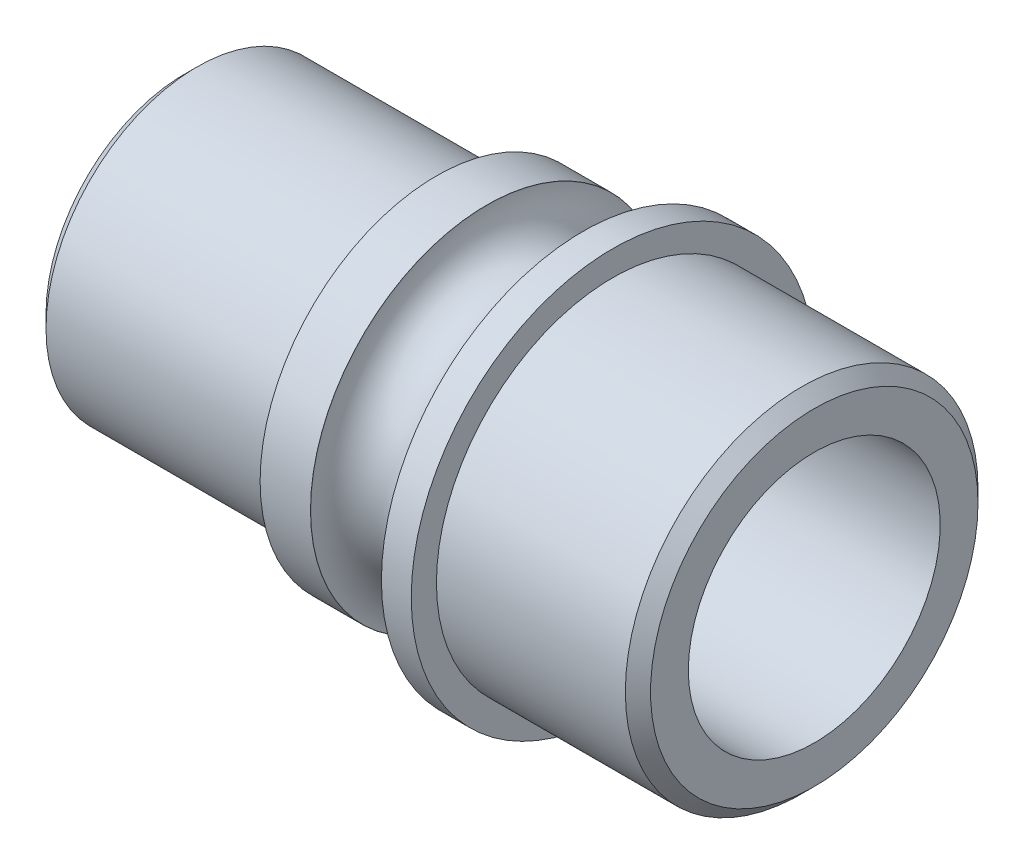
ISO-10303-21;
HEADER;
FILE_DESCRIPTION(('STEP AP214'),'2;1');
FILE_NAME('part.step','',(''),(''),'','','');
FILE_SCHEMA(('AUTOMOTIVE_DESIGN { 1 0 10303 214 1 1 1 1 }'));
ENDSEC;
DATA;
#1=APPLICATION_CONTEXT('core data for automotive mechanical design processes');
#2=APPLICATION_PROTOCOL_DEFINITION('international standard','automotive_design',2000,#1);
#3=PRODUCT_CONTEXT('',#1,'mechanical');
#4=PRODUCT('Part','Part','',(#3));
#5=PRODUCT_RELATED_PRODUCT_CATEGORY('part','',(#4));
#6=PRODUCT_DEFINITION_FORMATION('','',#4);
#7=PRODUCT_DEFINITION_CONTEXT('part definition',#1,'design');
#8=PRODUCT_DEFINITION('design','',#6,#7);
#9=PRODUCT_DEFINITION_SHAPE('','',#8);
#10=(LENGTH_UNIT() NAMED_UNIT(*) SI_UNIT(.MILLI.,.METRE.));
#11=(NAMED_UNIT(*) PLANE_ANGLE_UNIT() SI_UNIT($,.RADIAN.));
#12=(NAMED_UNIT(*) SI_UNIT($,.STERADIAN.) SOLID_ANGLE_UNIT());
#13=UNCERTAINTY_MEASURE_WITH_UNIT(LENGTH_MEASURE(1.E-05),#10,'distance_accuracy_value','');
#14=(GEOMETRIC_REPRESENTATION_CONTEXT(3) GLOBAL_UNCERTAINTY_ASSIGNED_CONTEXT((#13)) GLOBAL_UNIT_ASSIGNED_CONTEXT((#10,
#11,#12)) REPRESENTATION_CONTEXT('',''));
#15=CARTESIAN_POINT('',(0.,0.,0.));
#16=DIRECTION('',(0.,0.,1.));
#17=DIRECTION('',(1.,0.,0.));
#18=AXIS2_PLACEMENT_3D('',#15,#16,#17);
#19=CARTESIAN_POINT('',(-2.13336789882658,0.,0.));
#20=DIRECTION('',(1.,0.,0.));
#21=DIRECTION('',(0.,0.,-1.));
#22=AXIS2_PLACEMENT_3D('',#19,#20,#21);
#23=CONICAL_SURFACE('',#22,6.35604902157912,1.04719755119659);
#24=CARTESIAN_POINT('',(-1.18423235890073,0.,0.));
#25=DIRECTION('',(-1.,0.,0.));
#26=DIRECTION('',(0.,0.,1.));
#27=AXIS2_PLACEMENT_3D('',#24,#25,#26);
#28=CIRCLE('',#27,8.);
#29=CARTESIAN_POINT('',(-1.18423235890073,0.,8.));
#30=VERTEX_POINT('',#29);
#31=EDGE_CURVE('E108',#30,#30,#28,.T.);
#32=ORIENTED_EDGE('',*,*,#31,.T.);
#33=EDGE_LOOP('',(#32));
#34=FACE_BOUND('',#33,.T.);
#35=CARTESIAN_POINT('',(-2.13336789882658,0.,0.));
#36=DIRECTION('',(-1.,0.,0.));
#37=DIRECTION('',(0.,0.,1.));
#38=AXIS2_PLACEMENT_3D('',#35,#36,#37);
#39=CIRCLE('',#38,6.35604902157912);
#40=CARTESIAN_POINT('',(-2.13336789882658,0.,6.35604902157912));
#41=VERTEX_POINT('',#40);
#42=EDGE_CURVE('E73',#41,#41,#39,.T.);
#43=ORIENTED_EDGE('',*,*,#42,.F.);
#44=EDGE_LOOP('',(#43));
#45=FACE_BOUND('',#44,.T.);
#46=ADVANCED_FACE('F32',(#34,#45),#23,.T.);
#47=CARTESIAN_POINT('',(0.,0.,0.));
#48=DIRECTION('',(-1.,0.,0.));
#49=DIRECTION('',(0.,0.,1.));
#50=AXIS2_PLACEMENT_3D('',#47,#48,#49);
#51=CYLINDRICAL_SURFACE('',#50,6.35604902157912);
#52=ORIENTED_EDGE('',*,*,#42,.T.);
#53=EDGE_LOOP('',(#52));
#54=FACE_BOUND('',#53,.T.);
#55=CARTESIAN_POINT('',(-2.14007077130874,0.,0.));
#56=DIRECTION('',(-1.,0.,0.));
#57=DIRECTION('',(0.,0.,1.));
#58=AXIS2_PLACEMENT_3D('',#55,#56,#57);
#59=CIRCLE('',#58,6.35604902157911);
#60=CARTESIAN_POINT('',(-2.14007077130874,0.,6.35604902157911));
#61=VERTEX_POINT('',#60);
#62=EDGE_CURVE('E70',#61,#61,#59,.T.);
#63=ORIENTED_EDGE('',*,*,#62,.F.);
#64=EDGE_LOOP('',(#63));
#65=FACE_BOUND('',#64,.T.);
#66=ADVANCED_FACE('F98',(#54,#65),#51,.T.);
#67=CARTESIAN_POINT('',(-3.5,0.,0.));
#68=DIRECTION('',(-1.,0.,0.));
#69=DIRECTION('',(0.,0.,1.));
#70=AXIS2_PLACEMENT_3D('',#67,#68,#69);
#71=TOROIDAL_SURFACE('',#70,6.98897278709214,1.5);
#72=ORIENTED_EDGE('',*,*,#62,.T.);
#73=EDGE_LOOP('',(#72));
#74=FACE_BOUND('',#73,.T.);
#75=CARTESIAN_POINT('',(-5.,0.,0.));
#76=DIRECTION('',(-1.,0.,0.));
#77=DIRECTION('',(0.,0.,1.));
#78=AXIS2_PLACEMENT_3D('',#75,#76,#77);
#79=CIRCLE('',#78,6.98897278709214);
#80=CARTESIAN_POINT('',(-5.,0.,6.98897278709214));
#81=VERTEX_POINT('',#80);
#82=EDGE_CURVE('E67',#81,#81,#79,.T.);
#83=ORIENTED_EDGE('',*,*,#82,.F.);
#84=EDGE_LOOP('',(#83));
#85=FACE_BOUND('',#84,.T.);
#86=ADVANCED_FACE('F103',(#74,#85),#71,.F.);
#87=CARTESIAN_POINT('',(-5.,7.00000000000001,0.));
#88=DIRECTION('',(1.,0.,0.));
#89=DIRECTION('',(0.,0.,-1.));
#90=AXIS2_PLACEMENT_3D('',#87,#88,#89);
#91=PLANE('',#90);
#92=ORIENTED_EDGE('',*,*,#82,.T.);
#93=EDGE_LOOP('',(#92));
#94=FACE_BOUND('',#93,.T.);
#95=CARTESIAN_POINT('',(-5.,0.,0.));
#96=DIRECTION('',(-1.,0.,0.));
#97=DIRECTION('',(0.,0.,1.));
#98=AXIS2_PLACEMENT_3D('',#95,#96,#97);
#99=CIRCLE('',#98,7.00000000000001);
#100=CARTESIAN_POINT('',(-5.,0.,7.00000000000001));
#101=VERTEX_POINT('',#100);
#102=EDGE_CURVE('E64',#101,#101,#99,.T.);
#103=ORIENTED_EDGE('',*,*,#102,.F.);
#104=EDGE_LOOP('',(#103));
#105=FACE_BOUND('',#104,.T.);
#106=ADVANCED_FACE('F115',(#94,#105),#91,.T.);
#107=CARTESIAN_POINT('',(0.,0.,0.));
#108=DIRECTION('',(-1.,0.,0.));
#109=DIRECTION('',(0.,0.,1.));
#110=AXIS2_PLACEMENT_3D('',#107,#108,#109);
#111=CYLINDRICAL_SURFACE('',#110,7.00000000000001);
#112=ORIENTED_EDGE('',*,*,#102,.T.);
#113=EDGE_LOOP('',(#112));
#114=FACE_BOUND('',#113,.T.);
#115=CARTESIAN_POINT('',(-7.,0.,0.));
#116=DIRECTION('',(-1.,0.,0.));
#117=DIRECTION('',(0.,0.,1.));
#118=AXIS2_PLACEMENT_3D('',#115,#116,#117);
#119=CIRCLE('',#118,7.);
#120=CARTESIAN_POINT('',(-7.,0.,7.));
#121=VERTEX_POINT('',#120);
#122=EDGE_CURVE('E55',#121,#121,#119,.T.);
#123=ORIENTED_EDGE('',*,*,#122,.F.);
#124=EDGE_LOOP('',(#123));
#125=FACE_BOUND('',#124,.T.);
#126=ADVANCED_FACE('F121',(#114,#125),#111,.T.);
#127=CARTESIAN_POINT('',(-7.,6.,0.));
#128=DIRECTION('',(-1.,0.,0.));
#129=DIRECTION('',(0.,0.,1.));
#130=AXIS2_PLACEMENT_3D('',#127,#128,#129);
#131=PLANE('',#130);
#132=ORIENTED_EDGE('',*,*,#122,.T.);
#133=EDGE_LOOP('',(#132));
#134=FACE_BOUND('',#133,.T.);
#135=CARTESIAN_POINT('',(-7.,0.,0.));
#136=DIRECTION('',(-1.,0.,0.));
#137=DIRECTION('',(0.,0.,1.));
#138=AXIS2_PLACEMENT_3D('',#135,#136,#137);
#139=CIRCLE('',#138,6.);
#140=CARTESIAN_POINT('',(-7.,0.,6.));
#141=VERTEX_POINT('',#140);
#142=EDGE_CURVE('E51',#141,#141,#139,.T.);
#143=ORIENTED_EDGE('',*,*,#142,.F.);
#144=EDGE_LOOP('',(#143));
#145=FACE_BOUND('',#144,.T.);
#146=ADVANCED_FACE('F127',(#134,#145),#131,.T.);
#147=CARTESIAN_POINT('',(0.,0.,0.));
#148=DIRECTION('',(-1.,0.,0.));
#149=DIRECTION('',(0.,0.,1.));
#150=AXIS2_PLACEMENT_3D('',#147,#148,#149);
#151=CYLINDRICAL_SURFACE('',#150,6.);
#152=CARTESIAN_POINT('',(-16.5,0.,0.));
#153=DIRECTION('',(-1.,0.,0.));
#154=DIRECTION('',(0.,0.,1.));
#155=AXIS2_PLACEMENT_3D('',#152,#153,#154);
#156=CIRCLE('',#155,6.);
#157=CARTESIAN_POINT('',(-16.5,0.,6.));
#158=VERTEX_POINT('',#157);
#159=EDGE_CURVE('E11',#158,#158,#156,.F.);
#160=ORIENTED_EDGE('',*,*,#159,.T.);
#161=EDGE_LOOP('',(#160));
#162=FACE_BOUND('',#161,.T.);
#163=ORIENTED_EDGE('',*,*,#142,.T.);
#164=EDGE_LOOP('',(#163));
#165=FACE_BOUND('',#164,.T.);
#166=ADVANCED_FACE('F133',(#162,#165),#151,.T.);
#167=CARTESIAN_POINT('',(-17.,0.,0.));
#168=DIRECTION('',(-1.,0.,0.));
#169=DIRECTION('',(0.,0.,1.));
#170=AXIS2_PLACEMENT_3D('',#167,#168,#169);
#171=PLANE('',#170);
#172=CARTESIAN_POINT('',(-17.,0.,0.));
#173=DIRECTION('',(-1.,0.,0.));
#174=DIRECTION('',(0.,0.,1.));
#175=AXIS2_PLACEMENT_3D('',#172,#173,#174);
#176=CIRCLE('',#175,5.49999999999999);
#177=CARTESIAN_POINT('',(-17.,0.,5.49999999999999));
#178=VERTEX_POINT('',#177);
#179=EDGE_CURVE('E38',#178,#178,#176,.T.);
#180=ORIENTED_EDGE('',*,*,#179,.T.);
#181=EDGE_LOOP('',(#180));
#182=FACE_BOUND('',#181,.T.);
#183=ADVANCED_FACE('F45',(#182),#171,.T.);
#184=CARTESIAN_POINT('',(-1.18423235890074,0.,0.));
#185=DIRECTION('',(1.,0.,0.));
#186=DIRECTION('',(0.,0.,-1.));
#187=AXIS2_PLACEMENT_3D('',#184,#185,#186);
#188=CONICAL_SURFACE('',#187,5.,1.04719755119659);
#189=CARTESIAN_POINT('',(-4.07098370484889,0.,0.));
#190=VERTEX_POINT('',#189);
#191=VERTEX_LOOP('',#190);
#192=FACE_BOUND('',#191,.T.);
#193=CARTESIAN_POINT('',(-1.18423235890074,0.,0.));
#194=DIRECTION('',(-1.,0.,0.));
#195=DIRECTION('',(0.,0.,1.));
#196=AXIS2_PLACEMENT_3D('',#193,#194,#195);
#197=CIRCLE('',#196,5.);
#198=CARTESIAN_POINT('',(-1.18423235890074,0.,5.));
#199=VERTEX_POINT('',#198);
#200=EDGE_CURVE('E49',#199,#199,#197,.T.);
#201=ORIENTED_EDGE('',*,*,#200,.F.);
#202=EDGE_LOOP('',(#201));
#203=FACE_BOUND('',#202,.T.);
#204=ADVANCED_FACE('F41',(#192,#203),#188,.F.);
#205=CARTESIAN_POINT('',(0.,0.,0.));
#206=DIRECTION('',(-1.,0.,0.));
#207=DIRECTION('',(0.,0.,1.));
#208=AXIS2_PLACEMENT_3D('',#205,#206,#207);
#209=CYLINDRICAL_SURFACE('',#208,5.);
#210=ORIENTED_EDGE('',*,*,#200,.T.);
#211=EDGE_LOOP('',(#210));
#212=FACE_BOUND('',#211,.T.);
#213=CARTESIAN_POINT('',(8.,0.,0.));
#214=DIRECTION('',(-1.,0.,0.));
#215=DIRECTION('',(0.,0.,1.));
#216=AXIS2_PLACEMENT_3D('',#213,#214,#215);
#217=CIRCLE('',#216,5.);
#218=CARTESIAN_POINT('',(8.,0.,5.));
#219=VERTEX_POINT('',#218);
#220=EDGE_CURVE('E52',#219,#219,#217,.T.);
#221=ORIENTED_EDGE('',*,*,#220,.F.);
#222=EDGE_LOOP('',(#221));
#223=FACE_BOUND('',#222,.T.);
#224=ADVANCED_FACE('F44',(#212,#223),#209,.F.);
#225=CARTESIAN_POINT('',(8.,7.,0.));
#226=DIRECTION('',(1.,0.,0.));
#227=DIRECTION('',(0.,0.,-1.));
#228=AXIS2_PLACEMENT_3D('',#225,#226,#227);
#229=PLANE('',#228);
#230=CARTESIAN_POINT('',(8.,0.,0.));
#231=DIRECTION('',(1.,0.,0.));
#232=DIRECTION('',(0.,0.,-1.));
#233=AXIS2_PLACEMENT_3D('',#230,#231,#232);
#234=CIRCLE('',#233,6.5);
#235=CARTESIAN_POINT('',(8.,0.,-6.5));
#236=VERTEX_POINT('',#235);
#237=EDGE_CURVE('E79',#236,#236,#234,.T.);
#238=ORIENTED_EDGE('',*,*,#237,.T.);
#239=EDGE_LOOP('',(#238));
#240=FACE_BOUND('',#239,.T.);
#241=ORIENTED_EDGE('',*,*,#220,.T.);
#242=EDGE_LOOP('',(#241));
#243=FACE_BOUND('',#242,.T.);
#244=ADVANCED_FACE('F147',(#240,#243),#229,.T.);
#245=CARTESIAN_POINT('',(0.,0.,0.));
#246=DIRECTION('',(-1.,0.,0.));
#247=DIRECTION('',(0.,0.,1.));
#248=AXIS2_PLACEMENT_3D('',#245,#246,#247);
#249=CYLINDRICAL_SURFACE('',#248,7.);
#250=CARTESIAN_POINT('',(7.49999999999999,0.,0.));
#251=DIRECTION('',(1.,0.,0.));
#252=DIRECTION('',(0.,0.,-1.));
#253=AXIS2_PLACEMENT_3D('',#250,#251,#252);
#254=CIRCLE('',#253,7.);
#255=CARTESIAN_POINT('',(7.49999999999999,0.,-7.));
#256=VERTEX_POINT('',#255);
#257=EDGE_CURVE('E76',#256,#256,#254,.F.);
#258=ORIENTED_EDGE('',*,*,#257,.T.);
#259=EDGE_LOOP('',(#258));
#260=FACE_BOUND('',#259,.T.);
#261=CARTESIAN_POINT('',(0.,0.,0.));
#262=DIRECTION('',(-1.,0.,0.));
#263=DIRECTION('',(0.,0.,1.));
#264=AXIS2_PLACEMENT_3D('',#261,#262,#263);
#265=CIRCLE('',#264,7.);
#266=CARTESIAN_POINT('',(0.,0.,7.));
#267=VERTEX_POINT('',#266);
#268=EDGE_CURVE('E58',#267,#267,#265,.T.);
#269=ORIENTED_EDGE('',*,*,#268,.F.);
#270=EDGE_LOOP('',(#269));
#271=FACE_BOUND('',#270,.T.);
#272=ADVANCED_FACE('F150',(#260,#271),#249,.T.);
#273=CARTESIAN_POINT('',(0.,8.,0.));
#274=DIRECTION('',(1.,0.,0.));
#275=DIRECTION('',(0.,0.,-1.));
#276=AXIS2_PLACEMENT_3D('',#273,#274,#275);
#277=PLANE('',#276);
#278=ORIENTED_EDGE('',*,*,#268,.T.);
#279=EDGE_LOOP('',(#278));
#280=FACE_BOUND('',#279,.T.);
#281=CARTESIAN_POINT('',(0.,0.,0.));
#282=DIRECTION('',(-1.,0.,0.));
#283=DIRECTION('',(0.,0.,1.));
#284=AXIS2_PLACEMENT_3D('',#281,#282,#283);
#285=CIRCLE('',#284,8.);
#286=CARTESIAN_POINT('',(0.,0.,8.));
#287=VERTEX_POINT('',#286);
#288=EDGE_CURVE('E166',#287,#287,#285,.T.);
#289=ORIENTED_EDGE('',*,*,#288,.F.);
#290=EDGE_LOOP('',(#289));
#291=FACE_BOUND('',#290,.T.);
#292=ADVANCED_FACE('F154',(#280,#291),#277,.T.);
#293=CARTESIAN_POINT('',(0.,0.,0.));
#294=DIRECTION('',(-1.,0.,0.));
#295=DIRECTION('',(0.,0.,1.));
#296=AXIS2_PLACEMENT_3D('',#293,#294,#295);
#297=CYLINDRICAL_SURFACE('',#296,8.);
#298=ORIENTED_EDGE('',*,*,#288,.T.);
#299=EDGE_LOOP('',(#298));
#300=FACE_BOUND('',#299,.T.);
#301=ORIENTED_EDGE('',*,*,#31,.F.);
#302=EDGE_LOOP('',(#301));
#303=FACE_BOUND('',#302,.T.);
#304=ADVANCED_FACE('F93',(#300,#303),#297,.T.);
#305=CARTESIAN_POINT('',(7.49999999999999,0.,0.));
#306=DIRECTION('',(-1.,0.,0.));
#307=DIRECTION('',(0.,0.,1.));
#308=AXIS2_PLACEMENT_3D('',#305,#306,#307);
#309=CONICAL_SURFACE('',#308,7.,0.785398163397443);
#310=ORIENTED_EDGE('',*,*,#237,.F.);
#311=EDGE_LOOP('',(#310));
#312=FACE_BOUND('',#311,.T.);
#313=ORIENTED_EDGE('',*,*,#257,.F.);
#314=EDGE_LOOP('',(#313));
#315=FACE_BOUND('',#314,.T.);
#316=ADVANCED_FACE('F87',(#312,#315),#309,.T.);
#317=CARTESIAN_POINT('',(-17.,0.,0.));
#318=DIRECTION('',(1.,0.,0.));
#319=DIRECTION('',(0.,0.,-1.));
#320=AXIS2_PLACEMENT_3D('',#317,#318,#319);
#321=CONICAL_SURFACE('',#320,5.49999999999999,0.785398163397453);
#322=ORIENTED_EDGE('',*,*,#159,.F.);
#323=EDGE_LOOP('',(#322));
#324=FACE_BOUND('',#323,.T.);
#325=ORIENTED_EDGE('',*,*,#179,.F.);
#326=EDGE_LOOP('',(#325));
#327=FACE_BOUND('',#326,.T.);
#328=ADVANCED_FACE('F85',(#324,#327),#321,.T.);
#329=CLOSED_SHELL('',(#46,#66,#86,#106,#126,#146,#166,#183,#204,#224,#244,#272,#292,#304,#316,#328));
#330=MANIFOLD_SOLID_BREP('B2',#329);
#331=ADVANCED_BREP_SHAPE_REPRESENTATION('',(#18,#330),#14);
#332=SHAPE_DEFINITION_REPRESENTATION(#9,#331);
ENDSEC;
END-ISO-10303-21;
